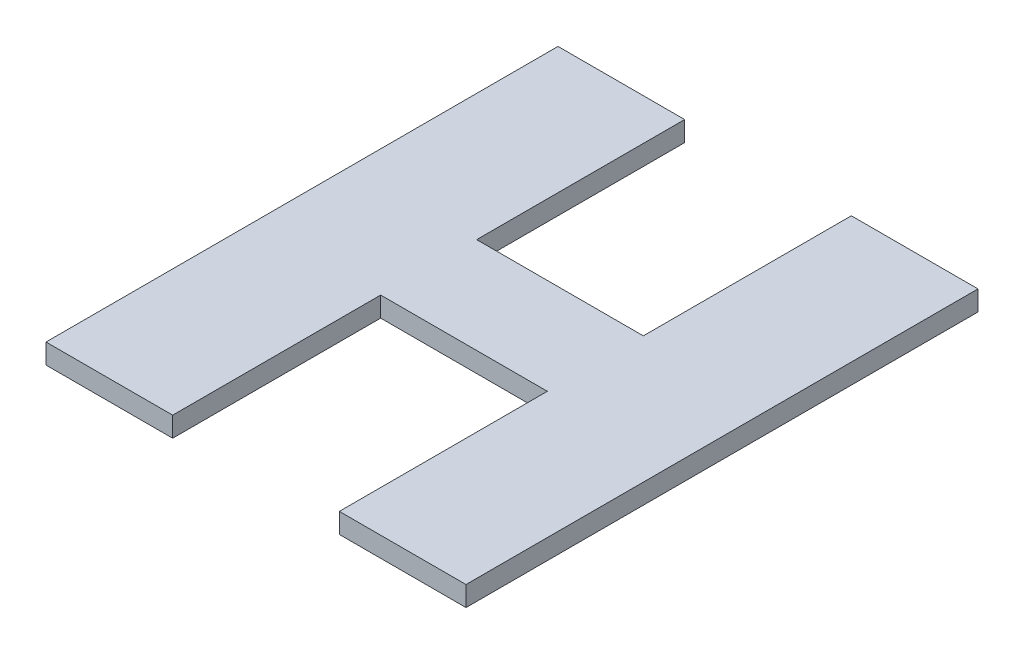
ISO-10303-21;
HEADER;
FILE_DESCRIPTION(('STEP AP214'),'2;1');
FILE_NAME('part.step','',(''),(''),'','','');
FILE_SCHEMA(('AUTOMOTIVE_DESIGN { 1 0 10303 214 1 1 1 1 }'));
ENDSEC;
DATA;
#1=APPLICATION_CONTEXT('core data for automotive mechanical design processes');
#2=APPLICATION_PROTOCOL_DEFINITION('international standard','automotive_design',2000,#1);
#3=PRODUCT_CONTEXT('',#1,'mechanical');
#4=PRODUCT('Part','Part','',(#3));
#5=PRODUCT_RELATED_PRODUCT_CATEGORY('part','',(#4));
#6=PRODUCT_DEFINITION_FORMATION('','',#4);
#7=PRODUCT_DEFINITION_CONTEXT('part definition',#1,'design');
#8=PRODUCT_DEFINITION('design','',#6,#7);
#9=PRODUCT_DEFINITION_SHAPE('','',#8);
#10=(LENGTH_UNIT() NAMED_UNIT(*) SI_UNIT(.MILLI.,.METRE.));
#11=(NAMED_UNIT(*) PLANE_ANGLE_UNIT() SI_UNIT($,.RADIAN.));
#12=(NAMED_UNIT(*) SI_UNIT($,.STERADIAN.) SOLID_ANGLE_UNIT());
#13=UNCERTAINTY_MEASURE_WITH_UNIT(LENGTH_MEASURE(1.E-05),#10,'distance_accuracy_value','');
#14=(GEOMETRIC_REPRESENTATION_CONTEXT(3) GLOBAL_UNCERTAINTY_ASSIGNED_CONTEXT((#13)) GLOBAL_UNIT_ASSIGNED_CONTEXT((#10,
#11,#12)) REPRESENTATION_CONTEXT('',''));
#15=CARTESIAN_POINT('',(0.,0.,0.));
#16=DIRECTION('',(0.,0.,1.));
#17=DIRECTION('',(1.,0.,0.));
#18=AXIS2_PLACEMENT_3D('',#15,#16,#17);
#19=CARTESIAN_POINT('',(-8.00099999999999,0.381,-9.7536));
#20=DIRECTION('',(0.,0.,1.));
#21=DIRECTION('',(1.,0.,0.));
#22=AXIS2_PLACEMENT_3D('',#19,#20,#21);
#23=PLANE('',#22);
#24=DIRECTION('',(-1.,0.,0.));
#25=VECTOR('',#24,1.);
#26=CARTESIAN_POINT('',(-8.00099999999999,-0.381,-9.7536));
#27=LINE('',#26,#25);
#28=CARTESIAN_POINT('',(8.001,-0.381,-9.7536));
#29=VERTEX_POINT('',#28);
#30=CARTESIAN_POINT('',(3.175,-0.381,-9.7536));
#31=VERTEX_POINT('',#30);
#32=EDGE_CURVE('E145',#29,#31,#27,.T.);
#33=ORIENTED_EDGE('',*,*,#32,.T.);
#34=DIRECTION('',(0.,1.,0.));
#35=VECTOR('',#34,1.);
#36=CARTESIAN_POINT('',(3.175,-0.381,-9.7536));
#37=LINE('',#36,#35);
#38=CARTESIAN_POINT('',(3.175,0.381,-9.7536));
#39=VERTEX_POINT('',#38);
#40=EDGE_CURVE('E178',#31,#39,#37,.T.);
#41=ORIENTED_EDGE('',*,*,#40,.T.);
#42=DIRECTION('',(-1.,0.,0.));
#43=VECTOR('',#42,1.);
#44=CARTESIAN_POINT('',(-8.00099999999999,0.381,-9.7536));
#45=LINE('',#44,#43);
#46=CARTESIAN_POINT('',(8.001,0.381,-9.7536));
#47=VERTEX_POINT('',#46);
#48=EDGE_CURVE('E157',#47,#39,#45,.T.);
#49=ORIENTED_EDGE('',*,*,#48,.F.);
#50=DIRECTION('',(0.,-1.,0.));
#51=VECTOR('',#50,1.);
#52=CARTESIAN_POINT('',(8.001,0.381,-9.7536));
#53=LINE('',#52,#51);
#54=EDGE_CURVE('E156',#47,#29,#53,.T.);
#55=ORIENTED_EDGE('',*,*,#54,.T.);
#56=EDGE_LOOP('',(#33,#41,#49,#55));
#57=FACE_BOUND('',#56,.T.);
#58=ADVANCED_FACE('F33',(#57),#23,.F.);
#59=CARTESIAN_POINT('',(-8.00099999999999,0.381,9.7536));
#60=DIRECTION('',(0.,0.,-1.));
#61=DIRECTION('',(-1.,0.,0.));
#62=AXIS2_PLACEMENT_3D('',#59,#60,#61);
#63=PLANE('',#62);
#64=DIRECTION('',(1.,0.,0.));
#65=VECTOR('',#64,1.);
#66=CARTESIAN_POINT('',(-8.00099999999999,0.381,9.7536));
#67=LINE('',#66,#65);
#68=CARTESIAN_POINT('',(3.175,0.381,9.7536));
#69=VERTEX_POINT('',#68);
#70=CARTESIAN_POINT('',(8.001,0.381,9.7536));
#71=VERTEX_POINT('',#70);
#72=EDGE_CURVE('E192',#69,#71,#67,.T.);
#73=ORIENTED_EDGE('',*,*,#72,.F.);
#74=DIRECTION('',(0.,1.,0.));
#75=VECTOR('',#74,1.);
#76=CARTESIAN_POINT('',(3.175,-0.381,9.7536));
#77=LINE('',#76,#75);
#78=CARTESIAN_POINT('',(3.175,-0.381,9.7536));
#79=VERTEX_POINT('',#78);
#80=EDGE_CURVE('E186',#79,#69,#77,.T.);
#81=ORIENTED_EDGE('',*,*,#80,.F.);
#82=DIRECTION('',(1.,0.,0.));
#83=VECTOR('',#82,1.);
#84=CARTESIAN_POINT('',(-8.00099999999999,-0.381,9.7536));
#85=LINE('',#84,#83);
#86=CARTESIAN_POINT('',(8.001,-0.381,9.7536));
#87=VERTEX_POINT('',#86);
#88=EDGE_CURVE('E172',#79,#87,#85,.T.);
#89=ORIENTED_EDGE('',*,*,#88,.T.);
#90=DIRECTION('',(0.,-1.,0.));
#91=VECTOR('',#90,1.);
#92=CARTESIAN_POINT('',(8.001,0.381,9.7536));
#93=LINE('',#92,#91);
#94=EDGE_CURVE('E41',#71,#87,#93,.T.);
#95=ORIENTED_EDGE('',*,*,#94,.F.);
#96=EDGE_LOOP('',(#73,#81,#89,#95));
#97=FACE_BOUND('',#96,.T.);
#98=ADVANCED_FACE('F191',(#97),#63,.F.);
#99=CARTESIAN_POINT('',(-8.00099999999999,0.381,-9.7536));
#100=DIRECTION('',(1.,0.,0.));
#101=DIRECTION('',(0.,0.,-1.));
#102=AXIS2_PLACEMENT_3D('',#99,#100,#101);
#103=PLANE('',#102);
#104=DIRECTION('',(0.,0.,1.));
#105=VECTOR('',#104,1.);
#106=CARTESIAN_POINT('',(-8.00099999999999,-0.381,-9.7536));
#107=LINE('',#106,#105);
#108=CARTESIAN_POINT('',(-8.00099999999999,-0.381,-9.7536));
#109=VERTEX_POINT('',#108);
#110=CARTESIAN_POINT('',(-8.00099999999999,-0.381,9.7536));
#111=VERTEX_POINT('',#110);
#112=EDGE_CURVE('E144',#109,#111,#107,.T.);
#113=ORIENTED_EDGE('',*,*,#112,.T.);
#114=DIRECTION('',(0.,-1.,0.));
#115=VECTOR('',#114,1.);
#116=CARTESIAN_POINT('',(-8.00099999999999,0.381,9.7536));
#117=LINE('',#116,#115);
#118=CARTESIAN_POINT('',(-8.00099999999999,0.381,9.7536));
#119=VERTEX_POINT('',#118);
#120=EDGE_CURVE('E11',#119,#111,#117,.T.);
#121=ORIENTED_EDGE('',*,*,#120,.F.);
#122=DIRECTION('',(0.,0.,1.));
#123=VECTOR('',#122,1.);
#124=CARTESIAN_POINT('',(-8.00099999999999,0.381,-9.7536));
#125=LINE('',#124,#123);
#126=CARTESIAN_POINT('',(-8.00099999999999,0.381,-9.7536));
#127=VERTEX_POINT('',#126);
#128=EDGE_CURVE('E149',#127,#119,#125,.T.);
#129=ORIENTED_EDGE('',*,*,#128,.F.);
#130=DIRECTION('',(0.,-1.,0.));
#131=VECTOR('',#130,1.);
#132=CARTESIAN_POINT('',(-8.00099999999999,0.381,-9.7536));
#133=LINE('',#132,#131);
#134=EDGE_CURVE('E154',#127,#109,#133,.T.);
#135=ORIENTED_EDGE('',*,*,#134,.T.);
#136=EDGE_LOOP('',(#113,#121,#129,#135));
#137=FACE_BOUND('',#136,.T.);
#138=ADVANCED_FACE('F35',(#137),#103,.F.);
#139=CARTESIAN_POINT('',(-3.175,-0.381,9.7536));
#140=VERTEX_POINT('',#139);
#141=EDGE_CURVE('E150',#111,#140,#85,.T.);
#142=ORIENTED_EDGE('',*,*,#141,.T.);
#143=DIRECTION('',(0.,1.,0.));
#144=VECTOR('',#143,1.);
#145=CARTESIAN_POINT('',(-3.175,-0.381,9.7536));
#146=LINE('',#145,#144);
#147=CARTESIAN_POINT('',(-3.175,0.381,9.7536));
#148=VERTEX_POINT('',#147);
#149=EDGE_CURVE('E196',#140,#148,#146,.T.);
#150=ORIENTED_EDGE('',*,*,#149,.T.);
#151=EDGE_CURVE('E208',#119,#148,#67,.T.);
#152=ORIENTED_EDGE('',*,*,#151,.F.);
#153=ORIENTED_EDGE('',*,*,#120,.T.);
#154=EDGE_LOOP('',(#142,#150,#152,#153));
#155=FACE_BOUND('',#154,.T.);
#156=ADVANCED_FACE('F255',(#155),#63,.F.);
#157=CARTESIAN_POINT('',(8.001,0.381,-9.7536));
#158=DIRECTION('',(-1.,0.,0.));
#159=DIRECTION('',(0.,0.,1.));
#160=AXIS2_PLACEMENT_3D('',#157,#158,#159);
#161=PLANE('',#160);
#162=DIRECTION('',(0.,0.,-1.));
#163=VECTOR('',#162,1.);
#164=CARTESIAN_POINT('',(8.001,-0.381,-9.7536));
#165=LINE('',#164,#163);
#166=EDGE_CURVE('E146',#87,#29,#165,.T.);
#167=ORIENTED_EDGE('',*,*,#166,.T.);
#168=ORIENTED_EDGE('',*,*,#54,.F.);
#169=DIRECTION('',(0.,0.,-1.));
#170=VECTOR('',#169,1.);
#171=CARTESIAN_POINT('',(8.001,0.381,-9.7536));
#172=LINE('',#171,#170);
#173=EDGE_CURVE('E166',#71,#47,#172,.T.);
#174=ORIENTED_EDGE('',*,*,#173,.F.);
#175=ORIENTED_EDGE('',*,*,#94,.T.);
#176=EDGE_LOOP('',(#167,#168,#174,#175));
#177=FACE_BOUND('',#176,.T.);
#178=ADVANCED_FACE('F164',(#177),#161,.F.);
#179=CARTESIAN_POINT('',(-3.175,0.381,-9.7536));
#180=VERTEX_POINT('',#179);
#181=EDGE_CURVE('E138',#180,#127,#45,.T.);
#182=ORIENTED_EDGE('',*,*,#181,.F.);
#183=DIRECTION('',(0.,1.,0.));
#184=VECTOR('',#183,1.);
#185=CARTESIAN_POINT('',(-3.175,-0.381,-9.7536));
#186=LINE('',#185,#184);
#187=CARTESIAN_POINT('',(-3.175,-0.381,-9.7536));
#188=VERTEX_POINT('',#187);
#189=EDGE_CURVE('E125',#188,#180,#186,.T.);
#190=ORIENTED_EDGE('',*,*,#189,.F.);
#191=EDGE_CURVE('E136',#188,#109,#27,.T.);
#192=ORIENTED_EDGE('',*,*,#191,.T.);
#193=ORIENTED_EDGE('',*,*,#134,.F.);
#194=EDGE_LOOP('',(#182,#190,#192,#193));
#195=FACE_BOUND('',#194,.T.);
#196=ADVANCED_FACE('F134',(#195),#23,.F.);
#197=CARTESIAN_POINT('',(-8.00099999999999,0.381,9.7536));
#198=DIRECTION('',(0.,1.,0.));
#199=DIRECTION('',(0.,0.,1.));
#200=AXIS2_PLACEMENT_3D('',#197,#198,#199);
#201=PLANE('',#200);
#202=DIRECTION('',(0.,0.,-1.));
#203=VECTOR('',#202,1.);
#204=CARTESIAN_POINT('',(3.175,0.381,-9.7536));
#205=LINE('',#204,#203);
#206=CARTESIAN_POINT('',(3.175,0.381,-1.8288));
#207=VERTEX_POINT('',#206);
#208=EDGE_CURVE('E130',#207,#39,#205,.T.);
#209=ORIENTED_EDGE('',*,*,#208,.F.);
#210=DIRECTION('',(1.,0.,0.));
#211=VECTOR('',#210,1.);
#212=CARTESIAN_POINT('',(3.175,0.381,-1.8288));
#213=LINE('',#212,#211);
#214=CARTESIAN_POINT('',(-3.175,0.381,-1.8288));
#215=VERTEX_POINT('',#214);
#216=EDGE_CURVE('E229',#215,#207,#213,.T.);
#217=ORIENTED_EDGE('',*,*,#216,.F.);
#218=DIRECTION('',(0.,0.,1.));
#219=VECTOR('',#218,1.);
#220=CARTESIAN_POINT('',(-3.175,0.381,-9.7536));
#221=LINE('',#220,#219);
#222=EDGE_CURVE('E232',#180,#215,#221,.T.);
#223=ORIENTED_EDGE('',*,*,#222,.F.);
#224=ORIENTED_EDGE('',*,*,#181,.T.);
#225=ORIENTED_EDGE('',*,*,#128,.T.);
#226=ORIENTED_EDGE('',*,*,#151,.T.);
#227=DIRECTION('',(0.,0.,1.));
#228=VECTOR('',#227,1.);
#229=CARTESIAN_POINT('',(-3.175,0.381,9.7536));
#230=LINE('',#229,#228);
#231=CARTESIAN_POINT('',(-3.175,0.381,1.8288));
#232=VERTEX_POINT('',#231);
#233=EDGE_CURVE('E201',#232,#148,#230,.T.);
#234=ORIENTED_EDGE('',*,*,#233,.F.);
#235=DIRECTION('',(-1.,0.,0.));
#236=VECTOR('',#235,1.);
#237=CARTESIAN_POINT('',(3.175,0.381,1.8288));
#238=LINE('',#237,#236);
#239=CARTESIAN_POINT('',(3.175,0.381,1.8288));
#240=VERTEX_POINT('',#239);
#241=EDGE_CURVE('E215',#240,#232,#238,.T.);
#242=ORIENTED_EDGE('',*,*,#241,.F.);
#243=DIRECTION('',(0.,0.,-1.));
#244=VECTOR('',#243,1.);
#245=CARTESIAN_POINT('',(3.175,0.381,9.7536));
#246=LINE('',#245,#244);
#247=EDGE_CURVE('E213',#69,#240,#246,.T.);
#248=ORIENTED_EDGE('',*,*,#247,.F.);
#249=ORIENTED_EDGE('',*,*,#72,.T.);
#250=ORIENTED_EDGE('',*,*,#173,.T.);
#251=ORIENTED_EDGE('',*,*,#48,.T.);
#252=EDGE_LOOP('',(#209,#217,#223,#224,#225,#226,#234,#242,#248,#249,#250,#251));
#253=FACE_BOUND('',#252,.T.);
#254=ADVANCED_FACE('F211',(#253),#201,.T.);
#255=CARTESIAN_POINT('',(-8.00099999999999,-0.381,9.7536));
#256=DIRECTION('',(0.,1.,0.));
#257=DIRECTION('',(0.,0.,1.));
#258=AXIS2_PLACEMENT_3D('',#255,#256,#257);
#259=PLANE('',#258);
#260=DIRECTION('',(1.,0.,0.));
#261=VECTOR('',#260,1.);
#262=CARTESIAN_POINT('',(3.175,-0.381,-1.8288));
#263=LINE('',#262,#261);
#264=CARTESIAN_POINT('',(-3.175,-0.381,-1.8288));
#265=VERTEX_POINT('',#264);
#266=CARTESIAN_POINT('',(3.175,-0.381,-1.8288));
#267=VERTEX_POINT('',#266);
#268=EDGE_CURVE('E48',#265,#267,#263,.T.);
#269=ORIENTED_EDGE('',*,*,#268,.T.);
#270=DIRECTION('',(0.,0.,-1.));
#271=VECTOR('',#270,1.);
#272=CARTESIAN_POINT('',(3.175,-0.381,-9.7536));
#273=LINE('',#272,#271);
#274=EDGE_CURVE('E139',#267,#31,#273,.T.);
#275=ORIENTED_EDGE('',*,*,#274,.T.);
#276=ORIENTED_EDGE('',*,*,#32,.F.);
#277=ORIENTED_EDGE('',*,*,#166,.F.);
#278=ORIENTED_EDGE('',*,*,#88,.F.);
#279=DIRECTION('',(0.,0.,-1.));
#280=VECTOR('',#279,1.);
#281=CARTESIAN_POINT('',(3.175,-0.381,9.7536));
#282=LINE('',#281,#280);
#283=CARTESIAN_POINT('',(3.175,-0.381,1.8288));
#284=VERTEX_POINT('',#283);
#285=EDGE_CURVE('E224',#79,#284,#282,.T.);
#286=ORIENTED_EDGE('',*,*,#285,.T.);
#287=DIRECTION('',(-1.,0.,0.));
#288=VECTOR('',#287,1.);
#289=CARTESIAN_POINT('',(3.175,-0.381,1.8288));
#290=LINE('',#289,#288);
#291=CARTESIAN_POINT('',(-3.175,-0.381,1.8288));
#292=VERTEX_POINT('',#291);
#293=EDGE_CURVE('E221',#284,#292,#290,.T.);
#294=ORIENTED_EDGE('',*,*,#293,.T.);
#295=DIRECTION('',(0.,0.,1.));
#296=VECTOR('',#295,1.);
#297=CARTESIAN_POINT('',(-3.175,-0.381,9.7536));
#298=LINE('',#297,#296);
#299=EDGE_CURVE('E56',#292,#140,#298,.T.);
#300=ORIENTED_EDGE('',*,*,#299,.T.);
#301=ORIENTED_EDGE('',*,*,#141,.F.);
#302=ORIENTED_EDGE('',*,*,#112,.F.);
#303=ORIENTED_EDGE('',*,*,#191,.F.);
#304=DIRECTION('',(0.,0.,1.));
#305=VECTOR('',#304,1.);
#306=CARTESIAN_POINT('',(-3.175,-0.381,-9.7536));
#307=LINE('',#306,#305);
#308=EDGE_CURVE('E121',#188,#265,#307,.T.);
#309=ORIENTED_EDGE('',*,*,#308,.T.);
#310=EDGE_LOOP('',(#269,#275,#276,#277,#278,#286,#294,#300,#301,#302,#303,#309));
#311=FACE_BOUND('',#310,.T.);
#312=ADVANCED_FACE('F142',(#311),#259,.F.);
#313=CARTESIAN_POINT('',(3.175,-0.381,9.7536));
#314=DIRECTION('',(1.,0.,0.));
#315=DIRECTION('',(0.,0.,-1.));
#316=AXIS2_PLACEMENT_3D('',#313,#314,#315);
#317=PLANE('',#316);
#318=ORIENTED_EDGE('',*,*,#247,.T.);
#319=DIRECTION('',(0.,1.,0.));
#320=VECTOR('',#319,1.);
#321=CARTESIAN_POINT('',(3.175,-0.381,1.8288));
#322=LINE('',#321,#320);
#323=EDGE_CURVE('E205',#284,#240,#322,.T.);
#324=ORIENTED_EDGE('',*,*,#323,.F.);
#325=ORIENTED_EDGE('',*,*,#285,.F.);
#326=ORIENTED_EDGE('',*,*,#80,.T.);
#327=EDGE_LOOP('',(#318,#324,#325,#326));
#328=FACE_BOUND('',#327,.T.);
#329=ADVANCED_FACE('F276',(#328),#317,.F.);
#330=CARTESIAN_POINT('',(-3.175,-0.381,9.7536));
#331=DIRECTION('',(-1.,0.,0.));
#332=DIRECTION('',(0.,0.,1.));
#333=AXIS2_PLACEMENT_3D('',#330,#331,#332);
#334=PLANE('',#333);
#335=ORIENTED_EDGE('',*,*,#233,.T.);
#336=ORIENTED_EDGE('',*,*,#149,.F.);
#337=ORIENTED_EDGE('',*,*,#299,.F.);
#338=DIRECTION('',(0.,1.,0.));
#339=VECTOR('',#338,1.);
#340=CARTESIAN_POINT('',(-3.175,-0.381,1.8288));
#341=LINE('',#340,#339);
#342=EDGE_CURVE('E198',#292,#232,#341,.T.);
#343=ORIENTED_EDGE('',*,*,#342,.T.);
#344=EDGE_LOOP('',(#335,#336,#337,#343));
#345=FACE_BOUND('',#344,.T.);
#346=ADVANCED_FACE('F247',(#345),#334,.F.);
#347=CARTESIAN_POINT('',(3.175,-0.381,1.8288));
#348=DIRECTION('',(0.,0.,-1.));
#349=DIRECTION('',(-1.,0.,0.));
#350=AXIS2_PLACEMENT_3D('',#347,#348,#349);
#351=PLANE('',#350);
#352=ORIENTED_EDGE('',*,*,#241,.T.);
#353=ORIENTED_EDGE('',*,*,#342,.F.);
#354=ORIENTED_EDGE('',*,*,#293,.F.);
#355=ORIENTED_EDGE('',*,*,#323,.T.);
#356=EDGE_LOOP('',(#352,#353,#354,#355));
#357=FACE_BOUND('',#356,.T.);
#358=ADVANCED_FACE('F240',(#357),#351,.F.);
#359=CARTESIAN_POINT('',(3.175,-0.381,-9.7536));
#360=DIRECTION('',(1.,0.,0.));
#361=DIRECTION('',(0.,0.,-1.));
#362=AXIS2_PLACEMENT_3D('',#359,#360,#361);
#363=PLANE('',#362);
#364=ORIENTED_EDGE('',*,*,#208,.T.);
#365=ORIENTED_EDGE('',*,*,#40,.F.);
#366=ORIENTED_EDGE('',*,*,#274,.F.);
#367=DIRECTION('',(0.,1.,0.));
#368=VECTOR('',#367,1.);
#369=CARTESIAN_POINT('',(3.175,-0.381,-1.8288));
#370=LINE('',#369,#368);
#371=EDGE_CURVE('E217',#267,#207,#370,.T.);
#372=ORIENTED_EDGE('',*,*,#371,.T.);
#373=EDGE_LOOP('',(#364,#365,#366,#372));
#374=FACE_BOUND('',#373,.T.);
#375=ADVANCED_FACE('F238',(#374),#363,.F.);
#376=CARTESIAN_POINT('',(3.175,-0.381,-1.8288));
#377=DIRECTION('',(0.,0.,1.));
#378=DIRECTION('',(1.,0.,0.));
#379=AXIS2_PLACEMENT_3D('',#376,#377,#378);
#380=PLANE('',#379);
#381=ORIENTED_EDGE('',*,*,#216,.T.);
#382=ORIENTED_EDGE('',*,*,#371,.F.);
#383=ORIENTED_EDGE('',*,*,#268,.F.);
#384=DIRECTION('',(0.,1.,0.));
#385=VECTOR('',#384,1.);
#386=CARTESIAN_POINT('',(-3.175,-0.381,-1.8288));
#387=LINE('',#386,#385);
#388=EDGE_CURVE('E127',#265,#215,#387,.T.);
#389=ORIENTED_EDGE('',*,*,#388,.T.);
#390=EDGE_LOOP('',(#381,#382,#383,#389));
#391=FACE_BOUND('',#390,.T.);
#392=ADVANCED_FACE('F236',(#391),#380,.F.);
#393=CARTESIAN_POINT('',(-3.175,-0.381,-9.7536));
#394=DIRECTION('',(-1.,0.,0.));
#395=DIRECTION('',(0.,0.,1.));
#396=AXIS2_PLACEMENT_3D('',#393,#394,#395);
#397=PLANE('',#396);
#398=ORIENTED_EDGE('',*,*,#222,.T.);
#399=ORIENTED_EDGE('',*,*,#388,.F.);
#400=ORIENTED_EDGE('',*,*,#308,.F.);
#401=ORIENTED_EDGE('',*,*,#189,.T.);
#402=EDGE_LOOP('',(#398,#399,#400,#401));
#403=FACE_BOUND('',#402,.T.);
#404=ADVANCED_FACE('F124',(#403),#397,.F.);
#405=CLOSED_SHELL('',(#58,#98,#138,#156,#178,#196,#254,#312,#329,#346,#358,#375,#392,#404));
#406=MANIFOLD_SOLID_BREP('B2',#405);
#407=ADVANCED_BREP_SHAPE_REPRESENTATION('',(#18,#406),#14);
#408=SHAPE_DEFINITION_REPRESENTATION(#9,#407);
ENDSEC;
END-ISO-10303-21;
